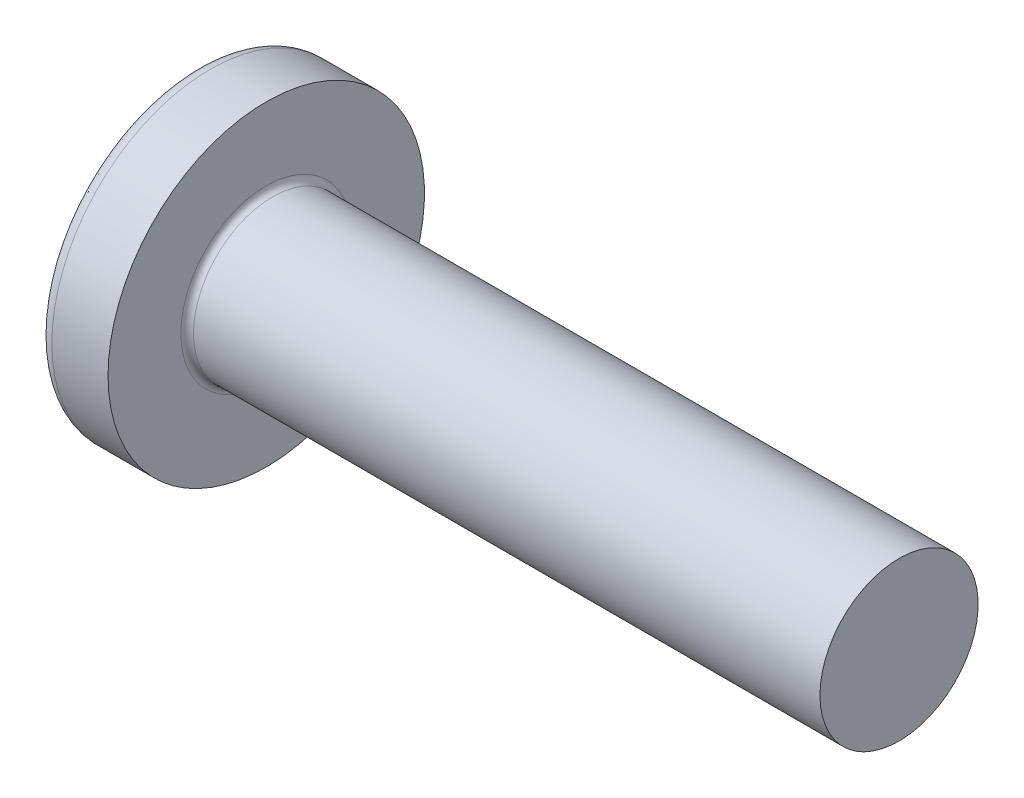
from build123d import *

# Parameters (mm, degrees)
FILLET1_R    = 0.4
RECPAT_COUNT = 2
RECPAT_ANGLE = 90


with BuildPart() as part:
    # BodySke → Base-Revolve (revolve)
    with BuildSketch(Plane.XY, mode=Mode.PRIVATE) as base_revolve_sk:
        with BuildLine():
            Line((7.5, 5), (7.5, 10))
            Line((7.5, 10), (3.950103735, 10))
            ThreePointArc((3.950103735, 10), (3.548946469, 9.905650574), (3.231897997, 9.642384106))
            ThreePointArc((3.231897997, 9.642384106), (0.82947542, 5.084799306), (0, 0))
            Line((0, 0), (47.5, 0))
            Line((47.5, 0), (47.5, 5))
            Line((47.5, 5), (7.5, 5))
        make_face()
    revolve(base_revolve_sk.sketch.rotate(Axis((3.950103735, 0, 0), (1, 0, 0)), 90), axis=Axis((3.950103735, 0, 0), (1, 0, 0)))

    # Fillet1
    fillet1_edges = [part.edges().sort_by_distance(p)[0] for p in [
        (7.5, 0, -5),
    ]]
    fillet(fillet1_edges, radius=FILLET1_R)

    # Sketch3 → Recess section 0
    with BuildSketch(Plane(origin=(0, 0, 0), x_dir=(0, 0, -1), z_dir=(1, 0, 0))):
        with BuildLine():
            Line((1.08, -4.95), (-1.08, -4.95))
            Line((-1.08, -4.95), (-1.08, 4.95))
            Line((-1.08, 4.95), (1.08, 4.95))
            Line((1.08, 4.95), (1.08, -4.95))
        make_face()
    # Sketch4 → Recess section 1
    with BuildSketch(Plane(origin=(5.69, 0, 0), x_dir=(0, 0, -1), z_dir=(1, 0, 0))):
        with BuildLine():
            Line((1.08, -2.113070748), (-1.08, -2.113070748))
            Line((-1.08, -2.113070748), (-1.08, 2.113070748))
            Line((-1.08, 2.113070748), (1.08, 2.113070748))
            Line((1.08, 2.113070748), (1.08, -2.113070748))
        make_face()
    recess = loft(mode=Mode.SUBTRACT)

    # RecPat: Recess ×2 about axis
    recpat_axis = Axis((0, 0, 0), (1, 0, 0))
    for i in range(1, RECPAT_COUNT):
        add(recess.rotate(recpat_axis, i * RECPAT_ANGLE / (RECPAT_COUNT - 1)), mode=Mode.SUBTRACT)

    # RecCorSke → RecessCore (revolve, cut)
    with BuildSketch(Plane.XY, mode=Mode.PRIVATE) as recesscore_sk:
        Polygon((0, 0), (0, 2.32838356), (5.69, 1.9305), (6.317257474, 0), align=None)
    revolve(recesscore_sk.sketch.rotate(Axis((-3.175, 0, 0), (1, 0, 0)), 13.226727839), axis=Axis((-3.175, 0, 0), (1, 0, 0)), mode=Mode.SUBTRACT)


solid = part.part
